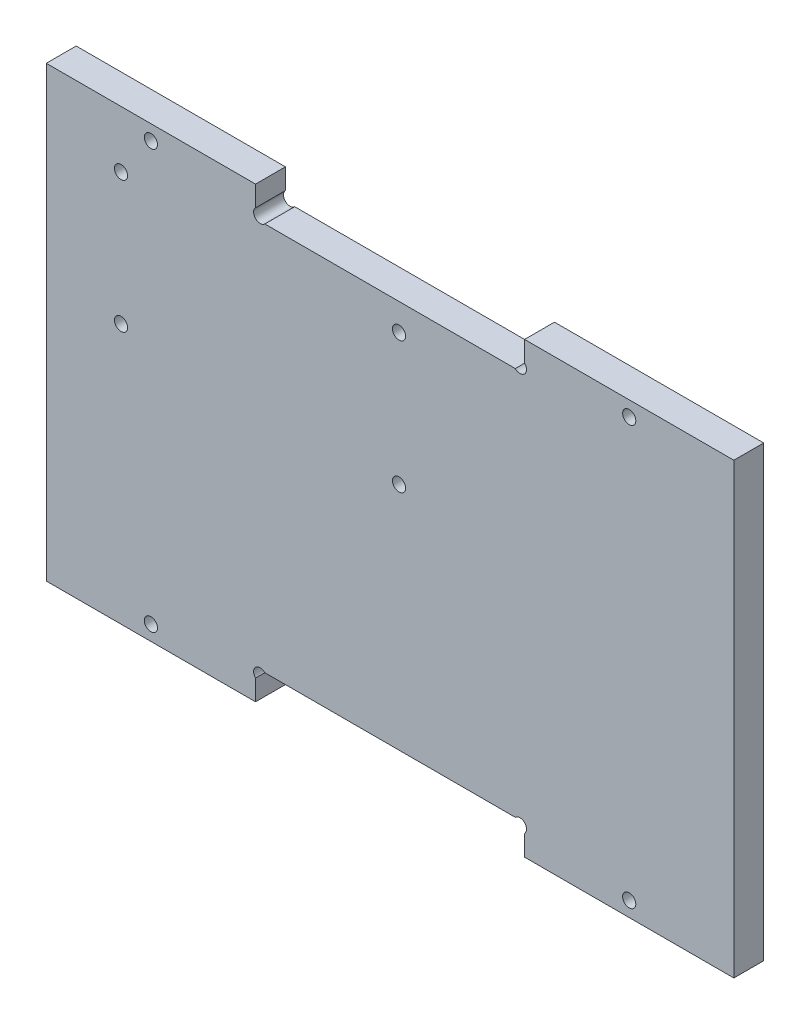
from build123d import *

# Parameters (mm, degrees)
ESQUISSE1_W               = 115
ESQUISSE1_H               = 75
BOSS_EXTRU_1_DEPTH        = 5
ENL_V_MAT_EXTRU_2_REACH   = 139.386
ESQUISSE3_R               = 1.1
ENL_V_MAT_EXTRU_4_REACH   = 139.386
ESQUISSE6_W               = 45
ESQUISSE6_H               = 5
ENL_V_START               = -5
ESQUISSE7_R               = 1.1
ENL_V_MAT_EXTRU_5_DEPTH   = 5
ENL_V_MAT_EXTRU_6_REACH   = 139.386
ESQUISSE8_R               = 1.1
SYM_TRIE2_COPY_1_REACH    = 139.386
SYM_TRIE2_COPY_1_SKETCH_R = 1.1


with BuildPart() as part:
    # Esquisse1 → Boss.-Extru.1 (new body)
    with BuildSketch(Plane.XY):
        with Locations((57.5, 37.5)):
            Rectangle(ESQUISSE1_W, ESQUISSE1_H)
    extrude(amount=BOSS_EXTRU_1_DEPTH)

    # Esquisse3 → Enl_v. mat.-Extru.2 (cut, up to next)
    with BuildSketch(Plane.XY.offset(5), mode=Mode.PRIVATE) as enl_v_mat_extru_2_sk1:
        with Locations((12.5, 65.5)):
            Circle(ESQUISSE3_R)
    enl_v_mat_extru_2_tool1 = extrude(enl_v_mat_extru_2_sk1.sketch, amount=-ENL_V_MAT_EXTRU_2_REACH, mode=Mode.PRIVATE) & part.part
    # Esquisse3 → Enl_v. mat.-Extru.2 (cut, up to next)
    with BuildSketch(Plane.XY.offset(5), mode=Mode.PRIVATE) as enl_v_mat_extru_2_sk2:
        with Locations((59, 65.5)):
            Circle(ESQUISSE3_R)
    enl_v_mat_extru_2_tool2 = extrude(enl_v_mat_extru_2_sk2.sketch, amount=-ENL_V_MAT_EXTRU_2_REACH, mode=Mode.PRIVATE) & part.part
    # Esquisse3 → Enl_v. mat.-Extru.2 (cut, up to next)
    with BuildSketch(Plane.XY.offset(5), mode=Mode.PRIVATE) as enl_v_mat_extru_2_sk3:
        with Locations((59, 43.5)):
            Circle(ESQUISSE3_R)
    enl_v_mat_extru_2_tool3 = extrude(enl_v_mat_extru_2_sk3.sketch, amount=-ENL_V_MAT_EXTRU_2_REACH, mode=Mode.PRIVATE) & part.part
    # Esquisse3 → Enl_v. mat.-Extru.2 (cut, up to next)
    with BuildSketch(Plane.XY.offset(5), mode=Mode.PRIVATE) as enl_v_mat_extru_2_sk4:
        with Locations((12.5, 43.5)):
            Circle(ESQUISSE3_R)
    enl_v_mat_extru_2_tool4 = extrude(enl_v_mat_extru_2_sk4.sketch, amount=-ENL_V_MAT_EXTRU_2_REACH, mode=Mode.PRIVATE) & part.part
    add(enl_v_mat_extru_2_tool1.solids().sort_by_distance((12.5, 65.5, 5))[0], mode=Mode.SUBTRACT)
    add(enl_v_mat_extru_2_tool2.solids().sort_by_distance((59, 65.5, 5))[0], mode=Mode.SUBTRACT)
    add(enl_v_mat_extru_2_tool3.solids().sort_by_distance((59, 43.5, 5))[0], mode=Mode.SUBTRACT)
    add(enl_v_mat_extru_2_tool4.solids().sort_by_distance((12.5, 43.5, 5))[0], mode=Mode.SUBTRACT)

    # Esquisse6 → Enl_v. mat.-Extru.4 (cut, up to next)
    with BuildSketch(Plane(origin=(0, 0, 0), x_dir=(-1, 0, 0), z_dir=(0, 0, -1)), mode=Mode.PRIVATE) as enl_v_mat_extru_4_sk1:
        with Locations((-57.5, 72.5)):
            Rectangle(ESQUISSE6_W, ESQUISSE6_H)
    enl_v_mat_extru_4_tool1 = extrude(enl_v_mat_extru_4_sk1.sketch, amount=-ENL_V_MAT_EXTRU_4_REACH, mode=Mode.PRIVATE) & part.part
    # Esquisse6 → Enl_v. mat.-Extru.4 (cut, up to next)
    with BuildSketch(Plane(origin=(0, 0, 0), x_dir=(-1, 0, 0), z_dir=(0, 0, -1)), mode=Mode.PRIVATE) as enl_v_mat_extru_4_sk2:
        with Locations((-57.5, 2.5)):
            Rectangle(ESQUISSE6_W, ESQUISSE6_H)
    enl_v_mat_extru_4_tool2 = extrude(enl_v_mat_extru_4_sk2.sketch, amount=-ENL_V_MAT_EXTRU_4_REACH, mode=Mode.PRIVATE) & part.part
    add(enl_v_mat_extru_4_tool1.solids().sort_by_distance((57.5, 72.5, 0))[0], mode=Mode.SUBTRACT)
    add(enl_v_mat_extru_4_tool2.solids().sort_by_distance((57.5, 2.5, 0))[0], mode=Mode.SUBTRACT)

    # Esquisse7 → Enl_v. mat.-Extru.5 (cut)
    with BuildSketch(Plane(origin=(0, 0, 0), x_dir=(-1, 0, 0), z_dir=(0, 0, -1)).offset(ENL_V_START)):
        with Locations((-35.777817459, 70.777817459)):
            Circle(ESQUISSE7_R)
        with Locations((-79.222182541, 70.777817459)):
            Circle(ESQUISSE7_R)
        with Locations((-79.222182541, 4.222182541)):
            Circle(ESQUISSE7_R)
        with Locations((-35.777817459, 4.222182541)):
            Circle(ESQUISSE7_R)
    extrude(amount=ENL_V_MAT_EXTRU_5_DEPTH, mode=Mode.SUBTRACT)

    # Esquisse8 → Enl_v. mat.-Extru.6 (cut, up to next)
    with BuildSketch(Plane(origin=(0, 0, 0), x_dir=(-1, 0, 0), z_dir=(0, 0, -1)), mode=Mode.PRIVATE) as enl_v_mat_extru_6_sk1:
        with Locations((-17.5, 72.5)):
            Circle(ESQUISSE8_R)
    enl_v_mat_extru_6_tool1 = extrude(enl_v_mat_extru_6_sk1.sketch, amount=-ENL_V_MAT_EXTRU_6_REACH, mode=Mode.PRIVATE) & part.part
    enl_v_mat_extru_6 = enl_v_mat_extru_6_tool1.solids().sort_by_distance((17.5, 72.5, 0))[0]
    add(enl_v_mat_extru_6, mode=Mode.SUBTRACT)

    # Sym_trie1: Enl_v. mat.-Extru.6 across plane
    add(enl_v_mat_extru_6.mirror(Plane(origin=(57.5, 0, 0), x_dir=(0, 0, 1), z_dir=(1, 0, 0))), mode=Mode.SUBTRACT)

    # Sym_trie2: Enl_v. mat.-Extru.6 across plane
    add(enl_v_mat_extru_6.mirror(Plane.ZX.offset(37.5)), mode=Mode.SUBTRACT)

    # Sym_trie2 copy 1 sketch → Sym_trie2 copy 1 (cut, up to next)
    with BuildSketch(Plane(origin=(115, 75, 0), x_dir=(1, 0, 0), z_dir=(0, 0, -1)), mode=Mode.PRIVATE) as sym_trie2_copy_1_sk1:
        with Locations((-17.5, 72.5)):
            Circle(SYM_TRIE2_COPY_1_SKETCH_R)
    sym_trie2_copy_1_tool1 = extrude(sym_trie2_copy_1_sk1.sketch, amount=-SYM_TRIE2_COPY_1_REACH, mode=Mode.PRIVATE) & part.part
    add(sym_trie2_copy_1_tool1.solids().sort_by_distance((97.5, 2.5, 0))[0], mode=Mode.SUBTRACT)


solid = part.part
